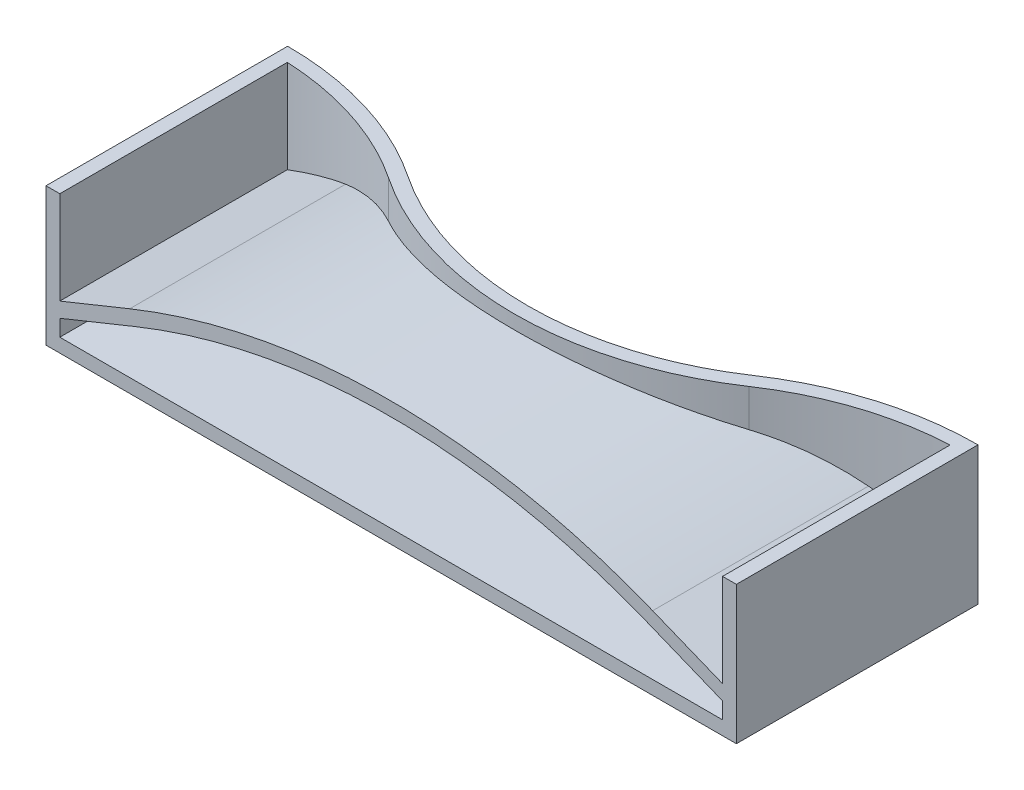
from build123d import *

# Parameters (mm, degrees)
EXTRUDE1_DEPTH = 20
SHELL1_T       = -2
RIB1_REACH     = 109.819


with BuildPart() as part:
    # Sketch2 → Extrude1 (new body)
    with BuildSketch(Plane(origin=(0, 0, 0), x_dir=(1, 0, 0), z_dir=(0, 1, 0))):
        with BuildLine():
            Line((0, 0), (0, 35))
            ThreePointArc((0, 35), (13.062430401, 33.062430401), (25, 27.416573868))
            ThreePointArc((25, 27.416573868), (50, 19.833147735), (75, 27.416573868))
            ThreePointArc((75, 27.416573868), (86.937569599, 33.062430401), (100, 35))
            Line((100, 35), (100, 0))
            Line((100, 0), (0, 0))
        make_face()
    extrude(amount=EXTRUDE1_DEPTH)

    # Shell1
    shell1_openings = [part.faces().sort_by_distance(p)[0] for p in [
        (50, 20, -14.28212744),
        (50, 10, 0),
    ]]
    offset(amount=SHELL1_T, openings=shell1_openings, kind=Kind.INTERSECTION)

    # Sketch4 walls → Rib1 (add, up to next)
    with BuildSketch(Plane.XY, mode=Mode.PRIVATE) as rib1_sk1:
        with BuildLine():
            Line((-88.003184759, -32.031778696), (12.875, 8.775456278))
            ThreePointArc((12.875, 8.775456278), (50, 16), (87.125, 8.775456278))
            Line((87.125, 8.775456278), (188.003184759, -32.031778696))
            Line((188.003184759, -32.031778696), (188.753184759, -30.177729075))
            Line((188.753184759, -30.177729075), (87.875, 10.6295059))
            ThreePointArc((87.875, 10.6295059), (50, 18), (12.125, 10.6295059))
            Line((12.125, 10.6295059), (-88.753184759, -30.177729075))
            Line((-88.753184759, -30.177729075), (-88.003184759, -32.031778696))
        make_face()
    rib1_tool1 = extrude(rib1_sk1.sketch, amount=-RIB1_REACH, mode=Mode.PRIVATE) - part.part
    add(rib1_tool1.solids().sort_by_distance((50, 17, 0))[0])


solid = part.part
